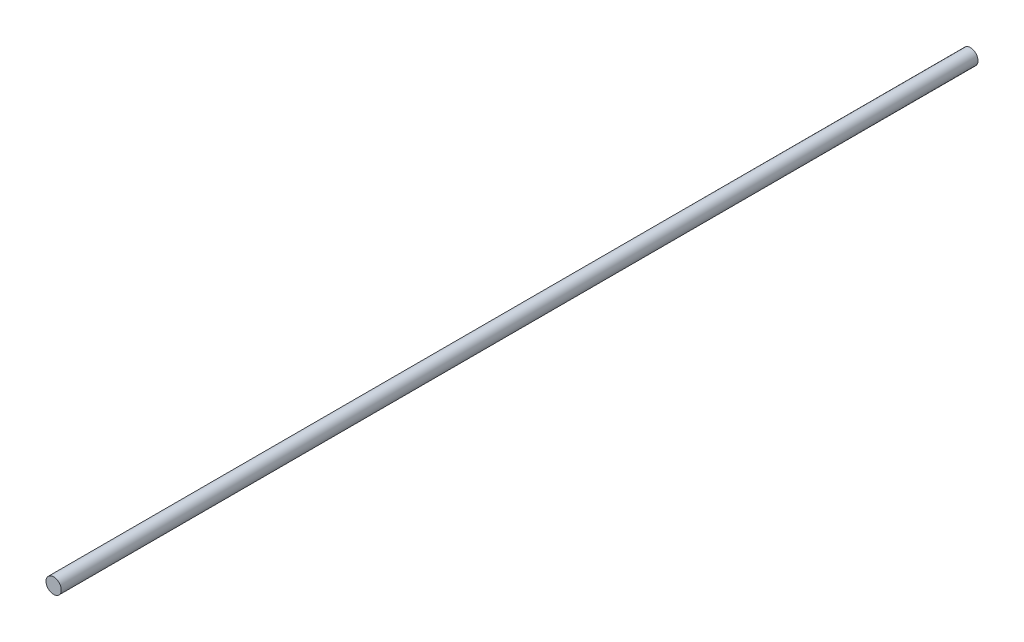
ISO-10303-21;
HEADER;
FILE_DESCRIPTION(('STEP AP214'),'2;1');
FILE_NAME('part.step','',(''),(''),'','','');
FILE_SCHEMA(('AUTOMOTIVE_DESIGN { 1 0 10303 214 1 1 1 1 }'));
ENDSEC;
DATA;
#1=APPLICATION_CONTEXT('core data for automotive mechanical design processes');
#2=APPLICATION_PROTOCOL_DEFINITION('international standard','automotive_design',2000,#1);
#3=PRODUCT_CONTEXT('',#1,'mechanical');
#4=PRODUCT('Part','Part','',(#3));
#5=PRODUCT_RELATED_PRODUCT_CATEGORY('part','',(#4));
#6=PRODUCT_DEFINITION_FORMATION('','',#4);
#7=PRODUCT_DEFINITION_CONTEXT('part definition',#1,'design');
#8=PRODUCT_DEFINITION('design','',#6,#7);
#9=PRODUCT_DEFINITION_SHAPE('','',#8);
#10=(LENGTH_UNIT() NAMED_UNIT(*) SI_UNIT(.MILLI.,.METRE.));
#11=(NAMED_UNIT(*) PLANE_ANGLE_UNIT() SI_UNIT($,.RADIAN.));
#12=(NAMED_UNIT(*) SI_UNIT($,.STERADIAN.) SOLID_ANGLE_UNIT());
#13=UNCERTAINTY_MEASURE_WITH_UNIT(LENGTH_MEASURE(1.E-05),#10,'distance_accuracy_value','');
#14=(GEOMETRIC_REPRESENTATION_CONTEXT(3) GLOBAL_UNCERTAINTY_ASSIGNED_CONTEXT((#13)) GLOBAL_UNIT_ASSIGNED_CONTEXT((#10,
#11,#12)) REPRESENTATION_CONTEXT('',''));
#15=CARTESIAN_POINT('',(0.,0.,0.));
#16=DIRECTION('',(0.,0.,1.));
#17=DIRECTION('',(1.,0.,0.));
#18=AXIS2_PLACEMENT_3D('',#15,#16,#17);
#19=CARTESIAN_POINT('',(-5.37251937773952,4.7480818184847,238.125));
#20=DIRECTION('',(0.,0.,-1.));
#21=DIRECTION('',(-1.,0.,0.));
#22=AXIS2_PLACEMENT_3D('',#19,#20,#21);
#23=CYLINDRICAL_SURFACE('',#22,1.9812);
#24=CARTESIAN_POINT('',(-5.37251937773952,4.7480818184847,238.125));
#25=DIRECTION('',(0.,0.,1.));
#26=DIRECTION('',(1.,0.,0.));
#27=AXIS2_PLACEMENT_3D('',#24,#25,#26);
#28=CIRCLE('',#27,1.9812);
#29=CARTESIAN_POINT('',(-3.39131937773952,4.7480818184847,238.125));
#30=VERTEX_POINT('',#29);
#31=EDGE_CURVE('E10',#30,#30,#28,.T.);
#32=ORIENTED_EDGE('',*,*,#31,.F.);
#33=EDGE_LOOP('',(#32));
#34=FACE_BOUND('',#33,.T.);
#35=CARTESIAN_POINT('',(-5.37251937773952,4.7480818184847,0.));
#36=DIRECTION('',(0.,0.,1.));
#37=DIRECTION('',(1.,0.,0.));
#38=AXIS2_PLACEMENT_3D('',#35,#36,#37);
#39=CIRCLE('',#38,1.9812);
#40=CARTESIAN_POINT('',(-3.39131937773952,4.7480818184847,0.));
#41=VERTEX_POINT('',#40);
#42=EDGE_CURVE('E44',#41,#41,#39,.T.);
#43=ORIENTED_EDGE('',*,*,#42,.T.);
#44=EDGE_LOOP('',(#43));
#45=FACE_BOUND('',#44,.T.);
#46=ADVANCED_FACE('F41',(#34,#45),#23,.T.);
#47=CARTESIAN_POINT('',(-5.37251937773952,4.7480818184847,238.125));
#48=DIRECTION('',(0.,0.,1.));
#49=DIRECTION('',(1.,0.,0.));
#50=AXIS2_PLACEMENT_3D('',#47,#48,#49);
#51=PLANE('',#50);
#52=ORIENTED_EDGE('',*,*,#31,.T.);
#53=EDGE_LOOP('',(#52));
#54=FACE_BOUND('',#53,.T.);
#55=ADVANCED_FACE('F60',(#54),#51,.T.);
#56=CARTESIAN_POINT('',(-5.37251937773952,4.7480818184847,0.));
#57=DIRECTION('',(0.,0.,1.));
#58=DIRECTION('',(1.,0.,0.));
#59=AXIS2_PLACEMENT_3D('',#56,#57,#58);
#60=PLANE('',#59);
#61=ORIENTED_EDGE('',*,*,#42,.F.);
#62=EDGE_LOOP('',(#61));
#63=FACE_BOUND('',#62,.T.);
#64=ADVANCED_FACE('F58',(#63),#60,.F.);
#65=CLOSED_SHELL('',(#46,#55,#64));
#66=MANIFOLD_SOLID_BREP('B2',#65);
#67=ADVANCED_BREP_SHAPE_REPRESENTATION('',(#18,#66),#14);
#68=SHAPE_DEFINITION_REPRESENTATION(#9,#67);
ENDSEC;
END-ISO-10303-21;
